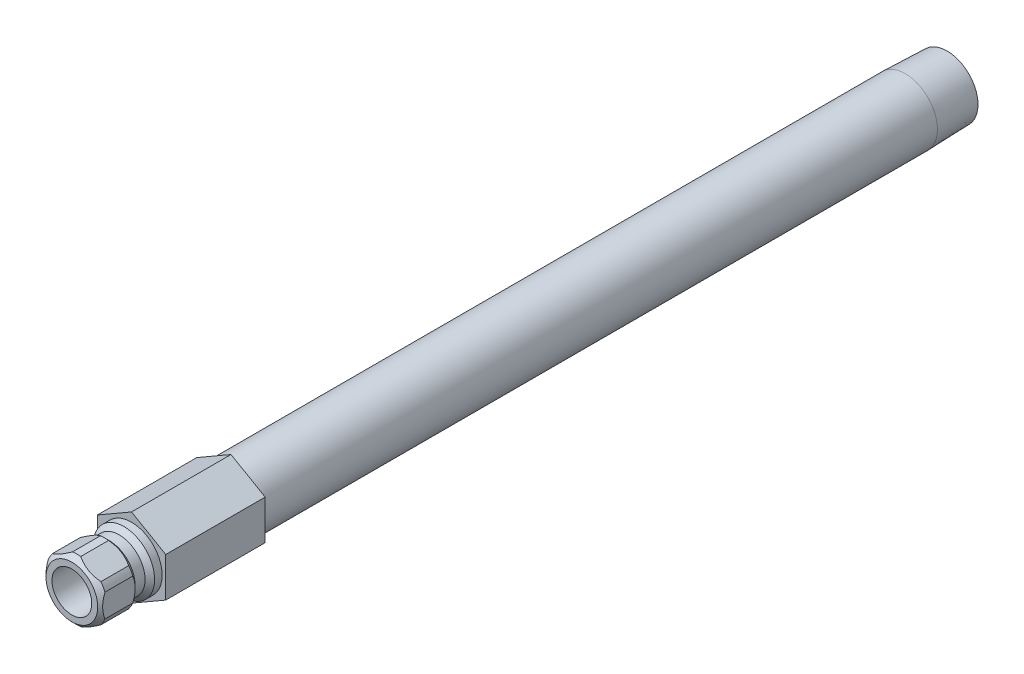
ISO-10303-21;
HEADER;
FILE_DESCRIPTION(('STEP AP214'),'2;1');
FILE_NAME('part.step','',(''),(''),'','','');
FILE_SCHEMA(('AUTOMOTIVE_DESIGN { 1 0 10303 214 1 1 1 1 }'));
ENDSEC;
DATA;
#1=APPLICATION_CONTEXT('core data for automotive mechanical design processes');
#2=APPLICATION_PROTOCOL_DEFINITION('international standard','automotive_design',2000,#1);
#3=PRODUCT_CONTEXT('',#1,'mechanical');
#4=PRODUCT('Part','Part','',(#3));
#5=PRODUCT_RELATED_PRODUCT_CATEGORY('part','',(#4));
#6=PRODUCT_DEFINITION_FORMATION('','',#4);
#7=PRODUCT_DEFINITION_CONTEXT('part definition',#1,'design');
#8=PRODUCT_DEFINITION('design','',#6,#7);
#9=PRODUCT_DEFINITION_SHAPE('','',#8);
#10=(LENGTH_UNIT() NAMED_UNIT(*) SI_UNIT(.MILLI.,.METRE.));
#11=(NAMED_UNIT(*) PLANE_ANGLE_UNIT() SI_UNIT($,.RADIAN.));
#12=(NAMED_UNIT(*) SI_UNIT($,.STERADIAN.) SOLID_ANGLE_UNIT());
#13=UNCERTAINTY_MEASURE_WITH_UNIT(LENGTH_MEASURE(1.E-05),#10,'distance_accuracy_value','');
#14=(GEOMETRIC_REPRESENTATION_CONTEXT(3) GLOBAL_UNCERTAINTY_ASSIGNED_CONTEXT((#13)) GLOBAL_UNIT_ASSIGNED_CONTEXT((#10,
#11,#12)) REPRESENTATION_CONTEXT('',''));
#15=CARTESIAN_POINT('',(0.,0.,0.));
#16=DIRECTION('',(0.,0.,1.));
#17=DIRECTION('',(1.,0.,0.));
#18=AXIS2_PLACEMENT_3D('',#15,#16,#17);
#19=CARTESIAN_POINT('',(0.,0.,0.));
#20=DIRECTION('',(0.,0.,-1.));
#21=DIRECTION('',(0.,1.,0.));
#22=AXIS2_PLACEMENT_3D('',#19,#20,#21);
#23=CYLINDRICAL_SURFACE('',#22,4.8895);
#24=DIRECTION('',(0.,0.,-1.));
#25=VECTOR('',#24,1.);
#26=CARTESIAN_POINT('',(-4.5212,-1.86170910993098,0.));
#27=LINE('',#26,#25);
#28=CARTESIAN_POINT('',(-4.5212,-1.86170910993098,4.318));
#29=VERTEX_POINT('',#28);
#30=CARTESIAN_POINT('',(-4.5212,-1.86170910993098,8.763));
#31=VERTEX_POINT('',#30);
#32=EDGE_CURVE('E61',#29,#31,#27,.F.);
#33=ORIENTED_EDGE('',*,*,#32,.F.);
#34=CARTESIAN_POINT('',(0.,0.,4.318));
#35=DIRECTION('',(0.,0.,-1.));
#36=DIRECTION('',(0.,1.,0.));
#37=AXIS2_PLACEMENT_3D('',#34,#35,#36);
#38=CIRCLE('',#37,4.8895);
#39=CARTESIAN_POINT('',(-3.87288738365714,-2.98461950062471,4.318));
#40=VERTEX_POINT('',#39);
#41=EDGE_CURVE('E650',#40,#29,#38,.T.);
#42=ORIENTED_EDGE('',*,*,#41,.F.);
#43=DIRECTION('',(0.,0.,-1.));
#44=VECTOR('',#43,1.);
#45=CARTESIAN_POINT('',(-3.87288738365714,-2.98461950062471,0.));
#46=LINE('',#45,#44);
#47=CARTESIAN_POINT('',(-3.87288738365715,-2.98461950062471,8.763));
#48=VERTEX_POINT('',#47);
#49=EDGE_CURVE('E218',#48,#40,#46,.T.);
#50=ORIENTED_EDGE('',*,*,#49,.F.);
#51=CARTESIAN_POINT('',(0.,0.,8.763));
#52=DIRECTION('',(0.,0.,-1.));
#53=DIRECTION('',(0.,1.,0.));
#54=AXIS2_PLACEMENT_3D('',#51,#52,#53);
#55=CIRCLE('',#54,4.8895);
#56=EDGE_CURVE('E189',#48,#31,#55,.T.);
#57=ORIENTED_EDGE('',*,*,#56,.T.);
#58=EDGE_LOOP('',(#33,#42,#50,#57));
#59=FACE_BOUND('',#58,.T.);
#60=ADVANCED_FACE('F34',(#59),#23,.T.);
#61=DIRECTION('',(0.,0.,-1.));
#62=VECTOR('',#61,1.);
#63=CARTESIAN_POINT('',(-0.648312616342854,-4.84632861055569,0.));
#64=LINE('',#63,#62);
#65=CARTESIAN_POINT('',(-0.648312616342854,-4.84632861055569,4.318));
#66=VERTEX_POINT('',#65);
#67=CARTESIAN_POINT('',(-0.648312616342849,-4.84632861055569,8.763));
#68=VERTEX_POINT('',#67);
#69=EDGE_CURVE('E232',#66,#68,#64,.F.);
#70=ORIENTED_EDGE('',*,*,#69,.F.);
#71=CARTESIAN_POINT('',(0.648312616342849,-4.84632861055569,4.318));
#72=VERTEX_POINT('',#71);
#73=EDGE_CURVE('E388',#72,#66,#38,.T.);
#74=ORIENTED_EDGE('',*,*,#73,.F.);
#75=DIRECTION('',(0.,0.,-1.));
#76=VECTOR('',#75,1.);
#77=CARTESIAN_POINT('',(0.648312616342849,-4.84632861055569,0.));
#78=LINE('',#77,#76);
#79=CARTESIAN_POINT('',(0.648312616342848,-4.84632861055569,8.763));
#80=VERTEX_POINT('',#79);
#81=EDGE_CURVE('E654',#80,#72,#78,.T.);
#82=ORIENTED_EDGE('',*,*,#81,.F.);
#83=EDGE_CURVE('E202',#80,#68,#55,.T.);
#84=ORIENTED_EDGE('',*,*,#83,.T.);
#85=EDGE_LOOP('',(#70,#74,#82,#84));
#86=FACE_BOUND('',#85,.T.);
#87=ADVANCED_FACE('F351',(#86),#23,.T.);
#88=DIRECTION('',(0.,0.,-1.));
#89=VECTOR('',#88,1.);
#90=CARTESIAN_POINT('',(3.87288738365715,-2.98461950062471,0.));
#91=LINE('',#90,#89);
#92=CARTESIAN_POINT('',(3.87288738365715,-2.98461950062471,4.318));
#93=VERTEX_POINT('',#92);
#94=CARTESIAN_POINT('',(3.87288738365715,-2.98461950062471,8.763));
#95=VERTEX_POINT('',#94);
#96=EDGE_CURVE('E294',#93,#95,#91,.F.);
#97=ORIENTED_EDGE('',*,*,#96,.F.);
#98=CARTESIAN_POINT('',(4.5212,-1.86170910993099,4.318));
#99=VERTEX_POINT('',#98);
#100=EDGE_CURVE('E384',#99,#93,#38,.T.);
#101=ORIENTED_EDGE('',*,*,#100,.F.);
#102=DIRECTION('',(0.,0.,-1.));
#103=VECTOR('',#102,1.);
#104=CARTESIAN_POINT('',(4.5212,-1.86170910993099,0.));
#105=LINE('',#104,#103);
#106=CARTESIAN_POINT('',(4.5212,-1.86170910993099,8.763));
#107=VERTEX_POINT('',#106);
#108=EDGE_CURVE('E377',#107,#99,#105,.T.);
#109=ORIENTED_EDGE('',*,*,#108,.F.);
#110=EDGE_CURVE('E195',#107,#95,#55,.T.);
#111=ORIENTED_EDGE('',*,*,#110,.T.);
#112=EDGE_LOOP('',(#97,#101,#109,#111));
#113=FACE_BOUND('',#112,.T.);
#114=ADVANCED_FACE('F355',(#113),#23,.T.);
#115=DIRECTION('',(0.,0.,-1.));
#116=VECTOR('',#115,1.);
#117=CARTESIAN_POINT('',(4.5212,1.86170910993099,0.));
#118=LINE('',#117,#116);
#119=CARTESIAN_POINT('',(4.5212,1.86170910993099,4.318));
#120=VERTEX_POINT('',#119);
#121=CARTESIAN_POINT('',(4.5212,1.86170910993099,8.763));
#122=VERTEX_POINT('',#121);
#123=EDGE_CURVE('E373',#120,#122,#118,.F.);
#124=ORIENTED_EDGE('',*,*,#123,.F.);
#125=CARTESIAN_POINT('',(3.87288738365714,2.98461950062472,4.318));
#126=VERTEX_POINT('',#125);
#127=EDGE_CURVE('E200',#126,#120,#38,.T.);
#128=ORIENTED_EDGE('',*,*,#127,.F.);
#129=DIRECTION('',(0.,0.,-1.));
#130=VECTOR('',#129,1.);
#131=CARTESIAN_POINT('',(3.87288738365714,2.98461950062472,0.));
#132=LINE('',#131,#130);
#133=CARTESIAN_POINT('',(3.87288738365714,2.98461950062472,8.763));
#134=VERTEX_POINT('',#133);
#135=EDGE_CURVE('E651',#134,#126,#132,.T.);
#136=ORIENTED_EDGE('',*,*,#135,.F.);
#137=EDGE_CURVE('E188',#134,#122,#55,.T.);
#138=ORIENTED_EDGE('',*,*,#137,.T.);
#139=EDGE_LOOP('',(#124,#128,#136,#138));
#140=FACE_BOUND('',#139,.T.);
#141=ADVANCED_FACE('F361',(#140),#23,.T.);
#142=DIRECTION('',(0.,0.,-1.));
#143=VECTOR('',#142,1.);
#144=CARTESIAN_POINT('',(0.648312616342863,4.84632861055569,0.));
#145=LINE('',#144,#143);
#146=CARTESIAN_POINT('',(0.648312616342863,4.84632861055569,4.318));
#147=VERTEX_POINT('',#146);
#148=CARTESIAN_POINT('',(0.648312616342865,4.84632861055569,8.763));
#149=VERTEX_POINT('',#148);
#150=EDGE_CURVE('E652',#147,#149,#145,.F.);
#151=ORIENTED_EDGE('',*,*,#150,.F.);
#152=CARTESIAN_POINT('',(-0.648312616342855,4.84632861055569,4.318));
#153=VERTEX_POINT('',#152);
#154=EDGE_CURVE('E179',#153,#147,#38,.T.);
#155=ORIENTED_EDGE('',*,*,#154,.F.);
#156=DIRECTION('',(0.,0.,-1.));
#157=VECTOR('',#156,1.);
#158=CARTESIAN_POINT('',(-0.648312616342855,4.84632861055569,0.));
#159=LINE('',#158,#157);
#160=CARTESIAN_POINT('',(-0.648312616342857,4.84632861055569,8.763));
#161=VERTEX_POINT('',#160);
#162=EDGE_CURVE('E163',#161,#153,#159,.T.);
#163=ORIENTED_EDGE('',*,*,#162,.F.);
#164=EDGE_CURVE('E177',#161,#149,#55,.T.);
#165=ORIENTED_EDGE('',*,*,#164,.T.);
#166=EDGE_LOOP('',(#151,#155,#163,#165));
#167=FACE_BOUND('',#166,.T.);
#168=ADVANCED_FACE('F176',(#167),#23,.T.);
#169=CARTESIAN_POINT('',(0.,4.8895,0.));
#170=DIRECTION('',(0.,0.,1.));
#171=DIRECTION('',(0.,-1.,0.));
#172=AXIS2_PLACEMENT_3D('',#169,#170,#171);
#173=PLANE('',#172);
#174=CARTESIAN_POINT('',(0.,0.,0.));
#175=DIRECTION('',(0.,0.,-1.));
#176=DIRECTION('',(0.,1.,0.));
#177=AXIS2_PLACEMENT_3D('',#174,#175,#176);
#178=CIRCLE('',#177,4.8895);
#179=CARTESIAN_POINT('',(0.,4.8895,0.));
#180=VERTEX_POINT('',#179);
#181=EDGE_CURVE('E395',#180,#180,#178,.T.);
#182=ORIENTED_EDGE('',*,*,#181,.T.);
#183=EDGE_LOOP('',(#182));
#184=FACE_BOUND('',#183,.T.);
#185=DIRECTION('',(-0.866025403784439,-0.5,0.));
#186=VECTOR('',#185,1.);
#187=CARTESIAN_POINT('',(0.,6.3058196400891,0.));
#188=LINE('',#187,#186);
#189=CARTESIAN_POINT('',(0.,6.3058196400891,0.));
#190=VERTEX_POINT('',#189);
#191=CARTESIAN_POINT('',(-5.461,3.15290982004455,0.));
#192=VERTEX_POINT('',#191);
#193=EDGE_CURVE('E445',#190,#192,#188,.T.);
#194=ORIENTED_EDGE('',*,*,#193,.T.);
#195=DIRECTION('',(0.,-1.,0.));
#196=VECTOR('',#195,1.);
#197=CARTESIAN_POINT('',(-5.461,3.15290982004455,0.));
#198=LINE('',#197,#196);
#199=CARTESIAN_POINT('',(-5.461,-3.15290982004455,0.));
#200=VERTEX_POINT('',#199);
#201=EDGE_CURVE('E448',#192,#200,#198,.T.);
#202=ORIENTED_EDGE('',*,*,#201,.T.);
#203=DIRECTION('',(0.866025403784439,-0.5,0.));
#204=VECTOR('',#203,1.);
#205=CARTESIAN_POINT('',(-5.461,-3.15290982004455,0.));
#206=LINE('',#205,#204);
#207=CARTESIAN_POINT('',(0.,-6.30581964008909,0.));
#208=VERTEX_POINT('',#207);
#209=EDGE_CURVE('E451',#200,#208,#206,.T.);
#210=ORIENTED_EDGE('',*,*,#209,.T.);
#211=DIRECTION('',(0.866025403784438,0.5,0.));
#212=VECTOR('',#211,1.);
#213=CARTESIAN_POINT('',(0.,-6.30581964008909,0.));
#214=LINE('',#213,#212);
#215=CARTESIAN_POINT('',(5.461,-3.15290982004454,0.));
#216=VERTEX_POINT('',#215);
#217=EDGE_CURVE('E454',#208,#216,#214,.T.);
#218=ORIENTED_EDGE('',*,*,#217,.T.);
#219=DIRECTION('',(0.,1.,0.));
#220=VECTOR('',#219,1.);
#221=CARTESIAN_POINT('',(5.461,-3.15290982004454,0.));
#222=LINE('',#221,#220);
#223=CARTESIAN_POINT('',(5.461,3.15290982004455,0.));
#224=VERTEX_POINT('',#223);
#225=EDGE_CURVE('E456',#216,#224,#222,.T.);
#226=ORIENTED_EDGE('',*,*,#225,.T.);
#227=DIRECTION('',(-0.866025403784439,0.5,0.));
#228=VECTOR('',#227,1.);
#229=CARTESIAN_POINT('',(5.461,3.15290982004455,0.));
#230=LINE('',#229,#228);
#231=EDGE_CURVE('E424',#224,#190,#230,.T.);
#232=ORIENTED_EDGE('',*,*,#231,.T.);
#233=EDGE_LOOP('',(#194,#202,#210,#218,#226,#232));
#234=FACE_BOUND('',#233,.T.);
#235=ADVANCED_FACE('F360',(#184,#234),#173,.T.);
#236=CARTESIAN_POINT('',(0.,0.,0.));
#237=DIRECTION('',(0.,0.,-1.));
#238=DIRECTION('',(0.,1.,0.));
#239=AXIS2_PLACEMENT_3D('',#236,#237,#238);
#240=CYLINDRICAL_SURFACE('',#239,4.8895);
#241=CARTESIAN_POINT('',(0.,0.,1.2065));
#242=DIRECTION('',(0.,0.,-1.));
#243=DIRECTION('',(0.,1.,0.));
#244=AXIS2_PLACEMENT_3D('',#241,#242,#243);
#245=CIRCLE('',#244,4.8895);
#246=CARTESIAN_POINT('',(0.,4.8895,1.2065));
#247=VERTEX_POINT('',#246);
#248=EDGE_CURVE('E392',#247,#247,#245,.T.);
#249=ORIENTED_EDGE('',*,*,#248,.T.);
#250=EDGE_LOOP('',(#249));
#251=FACE_BOUND('',#250,.T.);
#252=ORIENTED_EDGE('',*,*,#181,.F.);
#253=EDGE_LOOP('',(#252));
#254=FACE_BOUND('',#253,.T.);
#255=ADVANCED_FACE('F366',(#251,#254),#240,.T.);
#256=CARTESIAN_POINT('',(0.,0.,1.2065));
#257=DIRECTION('',(0.,0.,-1.));
#258=DIRECTION('',(0.,1.,0.));
#259=AXIS2_PLACEMENT_3D('',#256,#257,#258);
#260=CONICAL_SURFACE('',#259,4.8895,0.785398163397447);
#261=CARTESIAN_POINT('',(0.,0.,1.9685));
#262=DIRECTION('',(0.,0.,-1.));
#263=DIRECTION('',(0.,1.,0.));
#264=AXIS2_PLACEMENT_3D('',#261,#262,#263);
#265=CIRCLE('',#264,4.1275);
#266=CARTESIAN_POINT('',(0.,4.1275,1.9685));
#267=VERTEX_POINT('',#266);
#268=EDGE_CURVE('E386',#267,#267,#265,.T.);
#269=ORIENTED_EDGE('',*,*,#268,.T.);
#270=EDGE_LOOP('',(#269));
#271=FACE_BOUND('',#270,.T.);
#272=ORIENTED_EDGE('',*,*,#248,.F.);
#273=EDGE_LOOP('',(#272));
#274=FACE_BOUND('',#273,.T.);
#275=ADVANCED_FACE('F704',(#271,#274),#260,.T.);
#276=CARTESIAN_POINT('',(0.,0.,0.));
#277=DIRECTION('',(0.,0.,-1.));
#278=DIRECTION('',(0.,1.,0.));
#279=AXIS2_PLACEMENT_3D('',#276,#277,#278);
#280=CYLINDRICAL_SURFACE('',#279,4.1275);
#281=CARTESIAN_POINT('',(0.,0.,3.556));
#282=DIRECTION('',(0.,0.,-1.));
#283=DIRECTION('',(0.,1.,0.));
#284=AXIS2_PLACEMENT_3D('',#281,#282,#283);
#285=CIRCLE('',#284,4.1275);
#286=CARTESIAN_POINT('',(0.,4.1275,3.556));
#287=VERTEX_POINT('',#286);
#288=EDGE_CURVE('E383',#287,#287,#285,.T.);
#289=ORIENTED_EDGE('',*,*,#288,.T.);
#290=EDGE_LOOP('',(#289));
#291=FACE_BOUND('',#290,.T.);
#292=ORIENTED_EDGE('',*,*,#268,.F.);
#293=EDGE_LOOP('',(#292));
#294=FACE_BOUND('',#293,.T.);
#295=ADVANCED_FACE('F254',(#291,#294),#280,.T.);
#296=CARTESIAN_POINT('',(0.,0.,3.556));
#297=DIRECTION('',(0.,0.,1.));
#298=DIRECTION('',(0.,-1.,0.));
#299=AXIS2_PLACEMENT_3D('',#296,#297,#298);
#300=CONICAL_SURFACE('',#299,4.1275,0.785398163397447);
#301=CARTESIAN_POINT('',(-4.5212,-5.15925306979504,6.2884665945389));
#302=CARTESIAN_POINT('',(-4.5212,-5.03341781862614,6.19384981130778));
#303=CARTESIAN_POINT('',(-4.5212,-4.90687282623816,6.10016148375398));
#304=CARTESIAN_POINT('',(-4.5212,-4.65208542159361,5.91505573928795));
#305=CARTESIAN_POINT('',(-4.5212,-4.52384258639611,5.82363890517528));
#306=CARTESIAN_POINT('',(-4.5212,-4.26444371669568,5.64284060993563));
#307=CARTESIAN_POINT('',(-4.5212,-4.13327280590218,5.55348041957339));
#308=CARTESIAN_POINT('',(-4.5212,-3.86869655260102,5.37814219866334));
#309=CARTESIAN_POINT('',(-4.5212,-3.735291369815,5.29216392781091));
#310=CARTESIAN_POINT('',(-4.5212,-3.45835736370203,5.1196421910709));
#311=CARTESIAN_POINT('',(-4.5212,-3.31467977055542,5.03333631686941));
#312=CARTESIAN_POINT('',(-4.5212,-3.02397608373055,4.86646929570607));
#313=CARTESIAN_POINT('',(-4.5212,-2.87694947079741,4.78590904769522));
#314=CARTESIAN_POINT('',(-4.5212,-2.57957206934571,4.6322757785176));
#315=CARTESIAN_POINT('',(-4.5212,-2.42923274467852,4.55918074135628));
#316=CARTESIAN_POINT('',(-4.5212,-2.12448469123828,4.42211381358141));
#317=CARTESIAN_POINT('',(-4.5212,-1.97007782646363,4.35813782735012));
#318=CARTESIAN_POINT('',(-4.5212,-1.66898205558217,4.24604782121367));
#319=CARTESIAN_POINT('',(-4.5212,-1.52260919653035,4.19709368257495));
#320=CARTESIAN_POINT('',(-4.5212,-1.22638031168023,4.11093488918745));
#321=CARTESIAN_POINT('',(-4.5212,-1.07652404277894,4.07373105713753));
#322=CARTESIAN_POINT('',(-4.5212,-0.776693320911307,4.01362130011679));
#323=CARTESIAN_POINT('',(-4.5212,-0.626768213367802,3.99047322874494));
#324=CARTESIAN_POINT('',(-4.5212,-0.325366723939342,3.95891692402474));
#325=CARTESIAN_POINT('',(-4.5212,-0.173890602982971,3.95050625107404));
#326=CARTESIAN_POINT('',(-4.5212,0.123852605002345,3.94903068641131));
#327=CARTESIAN_POINT('',(-4.5212,0.270117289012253,3.95544130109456));
#328=CARTESIAN_POINT('',(-4.5212,0.561370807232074,3.98210770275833));
#329=CARTESIAN_POINT('',(-4.5212,0.706359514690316,4.0023648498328));
#330=CARTESIAN_POINT('',(-4.5212,0.996462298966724,4.05597163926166));
#331=CARTESIAN_POINT('',(-4.5212,1.14153485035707,4.08954247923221));
#332=CARTESIAN_POINT('',(-4.5212,1.42852462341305,4.16800024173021));
#333=CARTESIAN_POINT('',(-4.5212,1.5704421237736,4.21288616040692));
#334=CARTESIAN_POINT('',(-4.5212,1.86505501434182,4.3171412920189));
#335=CARTESIAN_POINT('',(-4.5212,2.01739126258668,4.37751543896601));
#336=CARTESIAN_POINT('',(-4.5212,2.31809735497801,4.5075182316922));
#337=CARTESIAN_POINT('',(-4.5212,2.46646529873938,4.57715121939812));
#338=CARTESIAN_POINT('',(-4.5212,2.75996557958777,4.72401353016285));
#339=CARTESIAN_POINT('',(-4.5212,2.90508583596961,4.80126680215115));
#340=CARTESIAN_POINT('',(-4.5212,3.19198335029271,4.96166050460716));
#341=CARTESIAN_POINT('',(-4.5212,3.33376113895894,5.04479999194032));
#342=CARTESIAN_POINT('',(-4.5212,3.60742153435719,5.21154136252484));
#343=CARTESIAN_POINT('',(-4.5212,3.73944496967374,5.29491333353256));
#344=CARTESIAN_POINT('',(-4.5212,4.00122581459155,5.4651527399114));
#345=CARTESIAN_POINT('',(-4.5212,4.13098305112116,5.55202044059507));
#346=CARTESIAN_POINT('',(-4.5212,4.387473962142,5.72790624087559));
#347=CARTESIAN_POINT('',(-4.5212,4.51422365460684,5.81690106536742));
#348=CARTESIAN_POINT('',(-4.5212,4.76599253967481,5.99723636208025));
#349=CARTESIAN_POINT('',(-4.5212,4.8910121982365,6.08857618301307));
#350=CARTESIAN_POINT('',(-4.5212,5.01530771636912,6.18087446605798));
#351=B_SPLINE_CURVE_WITH_KNOTS('',3,(#301,#302,#303,#304,#305,#306,#307,#308,#309,#310,#311,
#312,#313,#314,#315,#316,#317,#318,#319,#320,#321,#322,#323,#324,#325,#326,#327,#328,#329,#330,
#331,#332,#333,#334,#335,#336,#337,#338,#339,#340,#341,#342,#343,#344,#345,#346,#347,#348,#349,
#350),.UNSPECIFIED.,.F.,.F.,(4,2,2,2,2,2,2,2,2,2,2,2,2,2,2,2,2,2,2,2,2,2,2,2,4),(0.,
0.472324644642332,0.944769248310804,1.42087610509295,1.89694907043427,2.39966187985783,
2.90245317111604,3.40371602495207,3.90475303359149,4.3673713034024,4.83002195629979,
5.28445770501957,5.73881822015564,6.1773471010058,6.615919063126,7.06210522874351,
7.50825182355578,7.9994594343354,8.49089821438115,8.98393391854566,9.47689080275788,
9.94525924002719,10.4136632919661,10.8782525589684,11.3427141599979),.UNSPECIFIED.);
#352=CARTESIAN_POINT('',(-4.5212,1.86170910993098,4.318));
#353=VERTEX_POINT('',#352);
#354=EDGE_CURVE('E230',#353,#29,#351,.F.);
#355=ORIENTED_EDGE('',*,*,#354,.F.);
#356=CARTESIAN_POINT('',(-3.87288738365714,2.98461950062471,4.318));
#357=VERTEX_POINT('',#356);
#358=EDGE_CURVE('E199',#353,#357,#38,.T.);
#359=ORIENTED_EDGE('',*,*,#358,.T.);
#360=CARTESIAN_POINT('',(-0.647857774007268,4.84659121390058,4.3182));
#361=CARTESIAN_POINT('',(-0.775261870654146,4.77303442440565,4.26213711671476));
#362=CARTESIAN_POINT('',(-0.904457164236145,4.69844348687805,4.21102627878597));
#363=CARTESIAN_POINT('',(-1.16629518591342,4.5472712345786,4.12074318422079));
#364=CARTESIAN_POINT('',(-1.29894624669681,4.47068510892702,4.08160338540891));
#365=CARTESIAN_POINT('',(-1.56203676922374,4.31878972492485,4.01877592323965));
#366=CARTESIAN_POINT('',(-1.69238331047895,4.24353411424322,3.99458163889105));
#367=CARTESIAN_POINT('',(-1.95434729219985,4.09228913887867,3.96102228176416));
#368=CARTESIAN_POINT('',(-2.0859628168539,4.01630088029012,3.95163757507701));
#369=CARTESIAN_POINT('',(-2.35623055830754,3.86026172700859,3.9482192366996));
#370=CARTESIAN_POINT('',(-2.49489129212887,3.78020591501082,3.95501290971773));
#371=CARTESIAN_POINT('',(-2.7710334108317,3.62077518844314,3.98518499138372));
#372=CARTESIAN_POINT('',(-2.90851272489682,3.54140146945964,4.00858815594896));
#373=CARTESIAN_POINT('',(-3.18622016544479,3.38106700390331,4.07155129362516));
#374=CARTESIAN_POINT('',(-3.32634361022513,3.3001666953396,4.11171074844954));
#375=CARTESIAN_POINT('',(-3.60275664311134,3.14057955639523,4.20550294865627));
#376=CARTESIAN_POINT('',(-3.73905611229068,3.06188702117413,4.2590965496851));
#377=CARTESIAN_POINT('',(-3.87334222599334,2.98435689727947,4.31820000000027));
#378=B_SPLINE_CURVE_WITH_KNOTS('',3,(#360,#361,#362,#363,#364,#365,#366,#367,#368,#369,#370,
#371,#372,#373,#374,#375,#376,#377),.UNSPECIFIED.,.F.,.F.,(4,2,2,2,2,2,2,2,4),(0.,
0.472469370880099,0.946208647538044,1.40285320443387,1.85889185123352,2.33874707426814,
2.81931901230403,3.31879975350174,3.81684169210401),.UNSPECIFIED.);
#379=EDGE_CURVE('E260',#153,#357,#378,.T.);
#380=ORIENTED_EDGE('',*,*,#379,.F.);
#381=ORIENTED_EDGE('',*,*,#154,.T.);
#382=CARTESIAN_POINT('',(3.87334222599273,2.98435689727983,4.3182));
#383=CARTESIAN_POINT('',(3.74593812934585,3.05791368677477,4.26213711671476));
#384=CARTESIAN_POINT('',(3.61674283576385,3.13250462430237,4.21102627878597));
#385=CARTESIAN_POINT('',(3.35490481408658,3.28367687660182,4.12074318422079));
#386=CARTESIAN_POINT('',(3.22225375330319,3.3602630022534,4.08160338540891));
#387=CARTESIAN_POINT('',(2.95916323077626,3.51215838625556,4.01877592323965));
#388=CARTESIAN_POINT('',(2.82881668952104,3.5874139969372,3.99458163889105));
#389=CARTESIAN_POINT('',(2.56685270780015,3.73865897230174,3.96102228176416));
#390=CARTESIAN_POINT('',(2.4352371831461,3.81464723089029,3.95163757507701));
#391=CARTESIAN_POINT('',(2.16496944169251,3.97068638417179,3.94821923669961));
#392=CARTESIAN_POINT('',(2.02630870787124,4.05074219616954,3.95501290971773));
#393=CARTESIAN_POINT('',(1.75016658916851,4.21017292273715,3.98518499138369));
#394=CARTESIAN_POINT('',(1.61268727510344,4.28954664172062,4.00858815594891));
#395=CARTESIAN_POINT('',(1.33497983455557,4.44988110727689,4.07155129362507));
#396=CARTESIAN_POINT('',(1.19485638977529,4.53078141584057,4.11171074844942));
#397=CARTESIAN_POINT('',(0.918443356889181,4.69036855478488,4.20550294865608));
#398=CARTESIAN_POINT('',(0.782143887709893,4.76906109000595,4.25909654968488));
#399=CARTESIAN_POINT('',(0.647857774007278,4.84659121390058,4.3182));
#400=B_SPLINE_CURVE_WITH_KNOTS('',3,(#382,#383,#384,#385,#386,#387,#388,#389,#390,#391,#392,
#393,#394,#395,#396,#397,#398,#399),.UNSPECIFIED.,.F.,.F.,(4,2,2,2,2,2,2,2,4),(0.,
0.472469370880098,0.946208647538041,1.40285320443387,1.85889185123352,2.33874707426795,
2.81931901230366,3.31879975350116,3.81684169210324),.UNSPECIFIED.);
#401=EDGE_CURVE('E270',#126,#147,#400,.T.);
#402=ORIENTED_EDGE('',*,*,#401,.F.);
#403=ORIENTED_EDGE('',*,*,#127,.T.);
#404=CARTESIAN_POINT('',(4.5212,-5.15925306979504,6.2884665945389));
#405=CARTESIAN_POINT('',(4.5212,-5.03341781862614,6.19384981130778));
#406=CARTESIAN_POINT('',(4.5212,-4.90687282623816,6.10016148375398));
#407=CARTESIAN_POINT('',(4.5212,-4.65208542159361,5.91505573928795));
#408=CARTESIAN_POINT('',(4.5212,-4.52384258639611,5.82363890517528));
#409=CARTESIAN_POINT('',(4.5212,-4.26444371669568,5.64284060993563));
#410=CARTESIAN_POINT('',(4.5212,-4.13327280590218,5.55348041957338));
#411=CARTESIAN_POINT('',(4.5212,-3.86869655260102,5.37814219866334));
#412=CARTESIAN_POINT('',(4.5212,-3.735291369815,5.2921639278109));
#413=CARTESIAN_POINT('',(4.5212,-3.45835736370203,5.1196421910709));
#414=CARTESIAN_POINT('',(4.5212,-3.31467977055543,5.03333631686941));
#415=CARTESIAN_POINT('',(4.5212,-3.02397608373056,4.86646929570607));
#416=CARTESIAN_POINT('',(4.5212,-2.87694947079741,4.78590904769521));
#417=CARTESIAN_POINT('',(4.5212,-2.57957206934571,4.63227577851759));
#418=CARTESIAN_POINT('',(4.5212,-2.42923274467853,4.55918074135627));
#419=CARTESIAN_POINT('',(4.5212,-2.12448469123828,4.4221138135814));
#420=CARTESIAN_POINT('',(4.5212,-1.97007782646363,4.35813782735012));
#421=CARTESIAN_POINT('',(4.5212,-1.66898205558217,4.24604782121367));
#422=CARTESIAN_POINT('',(4.5212,-1.52260919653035,4.19709368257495));
#423=CARTESIAN_POINT('',(4.5212,-1.22638031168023,4.11093488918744));
#424=CARTESIAN_POINT('',(4.5212,-1.07652404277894,4.07373105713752));
#425=CARTESIAN_POINT('',(4.5212,-0.776693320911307,4.01362130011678));
#426=CARTESIAN_POINT('',(4.5212,-0.626768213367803,3.99047322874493));
#427=CARTESIAN_POINT('',(4.5212,-0.325366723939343,3.95891692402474));
#428=CARTESIAN_POINT('',(4.5212,-0.173890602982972,3.95050625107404));
#429=CARTESIAN_POINT('',(4.5212,0.123852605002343,3.94903068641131));
#430=CARTESIAN_POINT('',(4.5212,0.27011728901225,3.95544130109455));
#431=CARTESIAN_POINT('',(4.5212,0.561370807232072,3.98210770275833));
#432=CARTESIAN_POINT('',(4.5212,0.706359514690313,4.0023648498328));
#433=CARTESIAN_POINT('',(4.5212,0.99646229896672,4.05597163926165));
#434=CARTESIAN_POINT('',(4.5212,1.14153485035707,4.08954247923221));
#435=CARTESIAN_POINT('',(4.5212,1.42852462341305,4.16800024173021));
#436=CARTESIAN_POINT('',(4.5212,1.5704421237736,4.21288616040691));
#437=CARTESIAN_POINT('',(4.5212,1.86505501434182,4.3171412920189));
#438=CARTESIAN_POINT('',(4.5212,2.01739126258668,4.377515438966));
#439=CARTESIAN_POINT('',(4.5212,2.318097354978,4.50751823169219));
#440=CARTESIAN_POINT('',(4.5212,2.46646529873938,4.57715121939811));
#441=CARTESIAN_POINT('',(4.5212,2.75996557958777,4.72401353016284));
#442=CARTESIAN_POINT('',(4.5212,2.9050858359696,4.80126680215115));
#443=CARTESIAN_POINT('',(4.5212,3.1919833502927,4.96166050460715));
#444=CARTESIAN_POINT('',(4.5212,3.33376113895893,5.04479999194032));
#445=CARTESIAN_POINT('',(4.5212,3.60742153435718,5.21154136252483));
#446=CARTESIAN_POINT('',(4.5212,3.73944496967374,5.29491333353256));
#447=CARTESIAN_POINT('',(4.5212,4.00122581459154,5.46515273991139));
#448=CARTESIAN_POINT('',(4.5212,4.13098305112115,5.55202044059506));
#449=CARTESIAN_POINT('',(4.5212,4.38747396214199,5.72790624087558));
#450=CARTESIAN_POINT('',(4.5212,4.51422365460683,5.81690106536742));
#451=CARTESIAN_POINT('',(4.5212,4.76599253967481,5.99723636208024));
#452=CARTESIAN_POINT('',(4.5212,4.89101219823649,6.08857618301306));
#453=CARTESIAN_POINT('',(4.5212,5.01530771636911,6.18087446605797));
#454=B_SPLINE_CURVE_WITH_KNOTS('',3,(#404,#405,#406,#407,#408,#409,#410,#411,#412,#413,#414,
#415,#416,#417,#418,#419,#420,#421,#422,#423,#424,#425,#426,#427,#428,#429,#430,#431,#432,#433,
#434,#435,#436,#437,#438,#439,#440,#441,#442,#443,#444,#445,#446,#447,#448,#449,#450,#451,#452,
#453),.UNSPECIFIED.,.F.,.F.,(4,2,2,2,2,2,2,2,2,2,2,2,2,2,2,2,2,2,2,2,2,2,2,2,4),(0.,
0.472324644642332,0.944769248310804,1.42087610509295,1.89694907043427,2.39966187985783,
2.90245317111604,3.40371602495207,3.90475303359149,4.3673713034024,4.83002195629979,
5.28445770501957,5.73881822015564,6.1773471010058,6.615919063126,7.06210522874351,
7.50825182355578,7.9994594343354,8.49089821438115,8.98393391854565,9.47689080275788,
9.94525924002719,10.4136632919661,10.8782525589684,11.3427141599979),.UNSPECIFIED.);
#455=EDGE_CURVE('E279',#99,#120,#454,.T.);
#456=ORIENTED_EDGE('',*,*,#455,.F.);
#457=ORIENTED_EDGE('',*,*,#100,.T.);
#458=CARTESIAN_POINT('',(0.647857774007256,-4.84659121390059,4.3182));
#459=CARTESIAN_POINT('',(0.775261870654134,-4.77303442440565,4.26213711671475));
#460=CARTESIAN_POINT('',(0.904457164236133,-4.69844348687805,4.21102627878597));
#461=CARTESIAN_POINT('',(1.16629518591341,-4.5472712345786,4.12074318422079));
#462=CARTESIAN_POINT('',(1.2989462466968,-4.47068510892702,4.08160338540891));
#463=CARTESIAN_POINT('',(1.56203676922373,-4.31878972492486,4.01877592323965));
#464=CARTESIAN_POINT('',(1.69238331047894,-4.24353411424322,3.99458163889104));
#465=CARTESIAN_POINT('',(1.95434729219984,-4.09228913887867,3.96102228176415));
#466=CARTESIAN_POINT('',(2.08596281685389,-4.01630088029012,3.951637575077));
#467=CARTESIAN_POINT('',(2.35623055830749,-3.86026172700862,3.9482192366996));
#468=CARTESIAN_POINT('',(2.49489129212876,-3.78020591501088,3.95501290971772));
#469=CARTESIAN_POINT('',(2.77103341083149,-3.62077518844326,3.98518499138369));
#470=CARTESIAN_POINT('',(2.90851272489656,-3.54140146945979,4.0085881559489));
#471=CARTESIAN_POINT('',(3.18622016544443,-3.38106700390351,4.07155129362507));
#472=CARTESIAN_POINT('',(3.32634361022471,-3.30016669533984,4.11171074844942));
#473=CARTESIAN_POINT('',(3.60275664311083,-3.14057955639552,4.20550294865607));
#474=CARTESIAN_POINT('',(3.73905611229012,-3.06188702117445,4.25909654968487));
#475=CARTESIAN_POINT('',(3.87334222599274,-2.98435689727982,4.3182));
#476=B_SPLINE_CURVE_WITH_KNOTS('',3,(#458,#459,#460,#461,#462,#463,#464,#465,#466,#467,#468,
#469,#470,#471,#472,#473,#474,#475),.UNSPECIFIED.,.F.,.F.,(4,2,2,2,2,2,2,2,4),(0.,
0.4724693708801,0.946208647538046,1.40285320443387,1.85889185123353,2.33874707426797,
2.81931901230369,3.3187997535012,3.81684169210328),.UNSPECIFIED.);
#477=EDGE_CURVE('E287',#72,#93,#476,.T.);
#478=ORIENTED_EDGE('',*,*,#477,.F.);
#479=ORIENTED_EDGE('',*,*,#73,.T.);
#480=CARTESIAN_POINT('',(-3.87334222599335,-2.98435689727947,4.31820000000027));
#481=CARTESIAN_POINT('',(-3.74593812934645,-3.05791368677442,4.262137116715));
#482=CARTESIAN_POINT('',(-3.61674283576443,-3.13250462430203,4.21102627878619));
#483=CARTESIAN_POINT('',(-3.35490481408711,-3.28367687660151,4.12074318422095));
#484=CARTESIAN_POINT('',(-3.2222537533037,-3.3602630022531,4.08160338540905));
#485=CARTESIAN_POINT('',(-2.95916323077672,-3.51215838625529,4.01877592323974));
#486=CARTESIAN_POINT('',(-2.82881668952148,-3.58741399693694,3.99458163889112));
#487=CARTESIAN_POINT('',(-2.56685270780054,-3.73865897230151,3.96102228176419));
#488=CARTESIAN_POINT('',(-2.43523718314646,-3.81464723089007,3.95163757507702));
#489=CARTESIAN_POINT('',(-2.16496944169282,-3.97068638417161,3.94821923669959));
#490=CARTESIAN_POINT('',(-2.02630870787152,-4.05074219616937,3.95501290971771));
#491=CARTESIAN_POINT('',(-1.75016658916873,-4.21017292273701,3.98518499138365));
#492=CARTESIAN_POINT('',(-1.61268727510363,-4.2895466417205,4.00858815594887));
#493=CARTESIAN_POINT('',(-1.33497983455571,-4.44988110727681,4.07155129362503));
#494=CARTESIAN_POINT('',(-1.1948563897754,-4.5307814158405,4.11171074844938));
#495=CARTESIAN_POINT('',(-0.918443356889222,-4.69036855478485,4.20550294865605));
#496=CARTESIAN_POINT('',(-0.782143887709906,-4.76906109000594,4.25909654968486));
#497=CARTESIAN_POINT('',(-0.647857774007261,-4.84659121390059,4.3182));
#498=B_SPLINE_CURVE_WITH_KNOTS('',3,(#480,#481,#482,#483,#484,#485,#486,#487,#488,#489,#490,
#491,#492,#493,#494,#495,#496,#497),.UNSPECIFIED.,.F.,.F.,(4,2,2,2,2,2,2,2,4),(0.,
0.472469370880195,0.946208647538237,1.40285320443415,1.85889185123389,2.33874707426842,
2.81931901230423,3.31879975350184,3.81684169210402),.UNSPECIFIED.);
#499=EDGE_CURVE('E228',#40,#66,#498,.T.);
#500=ORIENTED_EDGE('',*,*,#499,.F.);
#501=ORIENTED_EDGE('',*,*,#41,.T.);
#502=EDGE_LOOP('',(#355,#359,#380,#381,#402,#403,#456,#457,#478,#479,#500,#501));
#503=FACE_BOUND('',#502,.T.);
#504=ORIENTED_EDGE('',*,*,#288,.F.);
#505=EDGE_LOOP('',(#504));
#506=FACE_BOUND('',#505,.T.);
#507=ADVANCED_FACE('F249',(#503,#506),#300,.T.);
#508=DIRECTION('',(0.,0.,-1.));
#509=VECTOR('',#508,1.);
#510=CARTESIAN_POINT('',(-4.5212,1.86170910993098,0.));
#511=LINE('',#510,#509);
#512=CARTESIAN_POINT('',(-4.5212,1.86170910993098,8.763));
#513=VERTEX_POINT('',#512);
#514=EDGE_CURVE('E222',#513,#353,#511,.T.);
#515=ORIENTED_EDGE('',*,*,#514,.F.);
#516=CARTESIAN_POINT('',(-3.87288738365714,2.98461950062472,8.763));
#517=VERTEX_POINT('',#516);
#518=EDGE_CURVE('E185',#513,#517,#55,.T.);
#519=ORIENTED_EDGE('',*,*,#518,.T.);
#520=DIRECTION('',(0.,0.,-1.));
#521=VECTOR('',#520,1.);
#522=CARTESIAN_POINT('',(-3.87288738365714,2.98461950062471,0.));
#523=LINE('',#522,#521);
#524=EDGE_CURVE('E54',#357,#517,#523,.F.);
#525=ORIENTED_EDGE('',*,*,#524,.F.);
#526=ORIENTED_EDGE('',*,*,#358,.F.);
#527=EDGE_LOOP('',(#515,#519,#525,#526));
#528=FACE_BOUND('',#527,.T.);
#529=ADVANCED_FACE('F226',(#528),#23,.T.);
#530=CARTESIAN_POINT('',(0.,0.,8.763));
#531=DIRECTION('',(0.,0.,-1.));
#532=DIRECTION('',(0.,1.,0.));
#533=AXIS2_PLACEMENT_3D('',#530,#531,#532);
#534=CONICAL_SURFACE('',#533,4.8895,0.785398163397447);
#535=CARTESIAN_POINT('',(-4.5212,-5.15925306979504,6.7925334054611));
#536=CARTESIAN_POINT('',(-4.5212,-5.03341781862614,6.88715018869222));
#537=CARTESIAN_POINT('',(-4.5212,-4.90687282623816,6.98083851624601));
#538=CARTESIAN_POINT('',(-4.5212,-4.65208542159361,7.16594426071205));
#539=CARTESIAN_POINT('',(-4.5212,-4.52384258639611,7.25736109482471));
#540=CARTESIAN_POINT('',(-4.5212,-4.26444371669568,7.43815939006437));
#541=CARTESIAN_POINT('',(-4.5212,-4.13327280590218,7.52751958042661));
#542=CARTESIAN_POINT('',(-4.5212,-3.86869655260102,7.70285780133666));
#543=CARTESIAN_POINT('',(-4.5212,-3.73529136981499,7.7888360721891));
#544=CARTESIAN_POINT('',(-4.5212,-3.45835736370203,7.9613578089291));
#545=CARTESIAN_POINT('',(-4.5212,-3.31467977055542,8.04766368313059));
#546=CARTESIAN_POINT('',(-4.5212,-3.02397608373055,8.21453070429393));
#547=CARTESIAN_POINT('',(-4.5212,-2.87694947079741,8.29509095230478));
#548=CARTESIAN_POINT('',(-4.5212,-2.57957206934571,8.4487242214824));
#549=CARTESIAN_POINT('',(-4.5212,-2.42923274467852,8.52181925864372));
#550=CARTESIAN_POINT('',(-4.5212,-2.12448469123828,8.6588861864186));
#551=CARTESIAN_POINT('',(-4.5212,-1.97007782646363,8.72286217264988));
#552=CARTESIAN_POINT('',(-4.5212,-1.66898205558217,8.83495217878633));
#553=CARTESIAN_POINT('',(-4.5212,-1.52260919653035,8.88390631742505));
#554=CARTESIAN_POINT('',(-4.5212,-1.22638031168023,8.97006511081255));
#555=CARTESIAN_POINT('',(-4.5212,-1.07652404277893,9.00726894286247));
#556=CARTESIAN_POINT('',(-4.5212,-0.776693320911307,9.06737869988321));
#557=CARTESIAN_POINT('',(-4.5212,-0.626768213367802,9.09052677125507));
#558=CARTESIAN_POINT('',(-4.5212,-0.325366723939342,9.12208307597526));
#559=CARTESIAN_POINT('',(-4.5212,-0.173890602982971,9.13049374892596));
#560=CARTESIAN_POINT('',(-4.5212,0.123852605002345,9.13196931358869));
#561=CARTESIAN_POINT('',(-4.5212,0.270117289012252,9.12555869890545));
#562=CARTESIAN_POINT('',(-4.5212,0.561370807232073,9.09889229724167));
#563=CARTESIAN_POINT('',(-4.5212,0.706359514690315,9.0786351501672));
#564=CARTESIAN_POINT('',(-4.5212,0.996462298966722,9.02502836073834));
#565=CARTESIAN_POINT('',(-4.5212,1.14153485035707,8.99145752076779));
#566=CARTESIAN_POINT('',(-4.5212,1.42852462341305,8.91299975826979));
#567=CARTESIAN_POINT('',(-4.5212,1.5704421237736,8.86811383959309));
#568=CARTESIAN_POINT('',(-4.5212,1.86505501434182,8.7638587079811));
#569=CARTESIAN_POINT('',(-4.5212,2.01739126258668,8.70348456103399));
#570=CARTESIAN_POINT('',(-4.5212,2.318097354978,8.5734817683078));
#571=CARTESIAN_POINT('',(-4.5212,2.46646529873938,8.50384878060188));
#572=CARTESIAN_POINT('',(-4.5212,2.75996557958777,8.35698646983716));
#573=CARTESIAN_POINT('',(-4.5212,2.90508583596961,8.27973319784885));
#574=CARTESIAN_POINT('',(-4.5212,3.1919833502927,8.11933949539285));
#575=CARTESIAN_POINT('',(-4.5212,3.33376113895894,8.03620000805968));
#576=CARTESIAN_POINT('',(-4.5212,3.60742153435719,7.86945863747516));
#577=CARTESIAN_POINT('',(-4.5212,3.73944496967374,7.78608666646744));
#578=CARTESIAN_POINT('',(-4.5212,4.00122581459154,7.6158472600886));
#579=CARTESIAN_POINT('',(-4.5212,4.13098305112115,7.52897955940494));
#580=CARTESIAN_POINT('',(-4.5212,4.38747396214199,7.35309375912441));
#581=CARTESIAN_POINT('',(-4.5212,4.51422365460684,7.26409893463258));
#582=CARTESIAN_POINT('',(-4.5212,4.76599253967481,7.08376363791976));
#583=CARTESIAN_POINT('',(-4.5212,4.8910121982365,6.99242381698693));
#584=CARTESIAN_POINT('',(-4.5212,5.01530771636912,6.90012553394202));
#585=B_SPLINE_CURVE_WITH_KNOTS('',3,(#535,#536,#537,#538,#539,#540,#541,#542,#543,#544,#545,
#546,#547,#548,#549,#550,#551,#552,#553,#554,#555,#556,#557,#558,#559,#560,#561,#562,#563,#564,
#565,#566,#567,#568,#569,#570,#571,#572,#573,#574,#575,#576,#577,#578,#579,#580,#581,#582,#583,
#584),.UNSPECIFIED.,.F.,.F.,(4,2,2,2,2,2,2,2,2,2,2,2,2,2,2,2,2,2,2,2,2,2,2,2,4),(0.,
0.472324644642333,0.944769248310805,1.42087610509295,1.89694907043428,2.39966187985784,
2.90245317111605,3.40371602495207,3.90475303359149,4.36737130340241,4.83002195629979,
5.28445770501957,5.73881822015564,6.1773471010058,6.615919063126,7.06210522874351,
7.50825182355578,7.9994594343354,8.49089821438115,8.98393391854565,9.47689080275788,
9.94525924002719,10.4136632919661,10.8782525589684,11.3427141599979),.UNSPECIFIED.);
#586=EDGE_CURVE('E12',#31,#513,#585,.T.);
#587=ORIENTED_EDGE('',*,*,#586,.F.);
#588=ORIENTED_EDGE('',*,*,#56,.F.);
#589=CARTESIAN_POINT('',(-0.647857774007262,-4.84659121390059,8.7628));
#590=CARTESIAN_POINT('',(-0.77526187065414,-4.77303442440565,8.81886288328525));
#591=CARTESIAN_POINT('',(-0.904457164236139,-4.69844348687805,8.86997372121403));
#592=CARTESIAN_POINT('',(-1.16629518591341,-4.5472712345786,8.96025681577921));
#593=CARTESIAN_POINT('',(-1.2989462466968,-4.47068510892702,8.99939661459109));
#594=CARTESIAN_POINT('',(-1.56203676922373,-4.31878972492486,9.06222407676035));
#595=CARTESIAN_POINT('',(-1.69238331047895,-4.24353411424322,9.08641836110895));
#596=CARTESIAN_POINT('',(-1.95434729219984,-4.09228913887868,9.11997771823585));
#597=CARTESIAN_POINT('',(-2.08596281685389,-4.01630088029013,9.12936242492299));
#598=CARTESIAN_POINT('',(-2.35623055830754,-3.86026172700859,9.1327807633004));
#599=CARTESIAN_POINT('',(-2.49489129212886,-3.78020591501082,9.12598709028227));
#600=CARTESIAN_POINT('',(-2.77103341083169,-3.62077518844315,9.09581500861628));
#601=CARTESIAN_POINT('',(-2.90851272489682,-3.54140146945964,9.07241184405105));
#602=CARTESIAN_POINT('',(-3.18622016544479,-3.38106700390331,9.00944870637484));
#603=CARTESIAN_POINT('',(-3.32634361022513,-3.3001666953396,8.96928925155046));
#604=CARTESIAN_POINT('',(-3.60275664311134,-3.14057955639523,8.87549705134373));
#605=CARTESIAN_POINT('',(-3.73905611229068,-3.06188702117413,8.8219034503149));
#606=CARTESIAN_POINT('',(-3.87334222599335,-2.98435689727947,8.76279999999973));
#607=B_SPLINE_CURVE_WITH_KNOTS('',3,(#589,#590,#591,#592,#593,#594,#595,#596,#597,#598,#599,
#600,#601,#602,#603,#604,#605,#606),.UNSPECIFIED.,.F.,.F.,(4,2,2,2,2,2,2,2,4),(0.,
0.4724693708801,0.946208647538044,1.40285320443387,1.85889185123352,2.33874707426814,
2.81931901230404,3.31879975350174,3.81684169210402),.UNSPECIFIED.);
#608=EDGE_CURVE('E47',#68,#48,#607,.T.);
#609=ORIENTED_EDGE('',*,*,#608,.F.);
#610=ORIENTED_EDGE('',*,*,#83,.F.);
#611=CARTESIAN_POINT('',(3.87334222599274,-2.98435689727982,8.7628));
#612=CARTESIAN_POINT('',(3.74593812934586,-3.05791368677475,8.81886288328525));
#613=CARTESIAN_POINT('',(3.61674283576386,-3.13250462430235,8.86997372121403));
#614=CARTESIAN_POINT('',(3.35490481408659,-3.2836768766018,8.96025681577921));
#615=CARTESIAN_POINT('',(3.2222537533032,-3.36026300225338,8.99939661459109));
#616=CARTESIAN_POINT('',(2.95916323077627,-3.51215838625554,9.06222407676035));
#617=CARTESIAN_POINT('',(2.82881668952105,-3.58741399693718,9.08641836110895));
#618=CARTESIAN_POINT('',(2.56685270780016,-3.73865897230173,9.11997771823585));
#619=CARTESIAN_POINT('',(2.43523718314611,-3.81464723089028,9.129362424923));
#620=CARTESIAN_POINT('',(2.16496944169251,-3.97068638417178,9.1327807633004));
#621=CARTESIAN_POINT('',(2.02630870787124,-4.05074219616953,9.12598709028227));
#622=CARTESIAN_POINT('',(1.75016658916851,-4.21017292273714,9.09581500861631));
#623=CARTESIAN_POINT('',(1.61268727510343,-4.28954664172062,9.0724118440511));
#624=CARTESIAN_POINT('',(1.33497983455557,-4.44988110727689,9.00944870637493));
#625=CARTESIAN_POINT('',(1.19485638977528,-4.53078141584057,8.96928925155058));
#626=CARTESIAN_POINT('',(0.918443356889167,-4.69036855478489,8.87549705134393));
#627=CARTESIAN_POINT('',(0.782143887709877,-4.76906109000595,8.82190345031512));
#628=CARTESIAN_POINT('',(0.647857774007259,-4.84659121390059,8.7628));
#629=B_SPLINE_CURVE_WITH_KNOTS('',3,(#611,#612,#613,#614,#615,#616,#617,#618,#619,#620,#621,
#622,#623,#624,#625,#626,#627,#628),.UNSPECIFIED.,.F.,.F.,(4,2,2,2,2,2,2,2,4),(0.,
0.472469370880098,0.946208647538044,1.40285320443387,1.85889185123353,2.33874707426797,
2.81931901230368,3.3187997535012,3.81684169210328),.UNSPECIFIED.);
#630=EDGE_CURVE('E305',#95,#80,#629,.T.);
#631=ORIENTED_EDGE('',*,*,#630,.F.);
#632=ORIENTED_EDGE('',*,*,#110,.F.);
#633=CARTESIAN_POINT('',(4.5212,-5.15925306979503,6.7925334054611));
#634=CARTESIAN_POINT('',(4.5212,-5.03341781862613,6.88715018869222));
#635=CARTESIAN_POINT('',(4.5212,-4.90687282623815,6.98083851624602));
#636=CARTESIAN_POINT('',(4.5212,-4.65208542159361,7.16594426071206));
#637=CARTESIAN_POINT('',(4.5212,-4.52384258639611,7.25736109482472));
#638=CARTESIAN_POINT('',(4.5212,-4.26444371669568,7.43815939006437));
#639=CARTESIAN_POINT('',(4.5212,-4.13327280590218,7.52751958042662));
#640=CARTESIAN_POINT('',(4.5212,-3.86869655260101,7.70285780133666));
#641=CARTESIAN_POINT('',(4.5212,-3.73529136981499,7.7888360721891));
#642=CARTESIAN_POINT('',(4.5212,-3.45835736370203,7.9613578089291));
#643=CARTESIAN_POINT('',(4.5212,-3.31467977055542,8.04766368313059));
#644=CARTESIAN_POINT('',(4.5212,-3.02397608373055,8.21453070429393));
#645=CARTESIAN_POINT('',(4.5212,-2.87694947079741,8.29509095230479));
#646=CARTESIAN_POINT('',(4.5212,-2.57957206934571,8.44872422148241));
#647=CARTESIAN_POINT('',(4.5212,-2.42923274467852,8.52181925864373));
#648=CARTESIAN_POINT('',(4.5212,-2.12448469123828,8.6588861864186));
#649=CARTESIAN_POINT('',(4.5212,-1.97007782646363,8.72286217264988));
#650=CARTESIAN_POINT('',(4.5212,-1.66898205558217,8.83495217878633));
#651=CARTESIAN_POINT('',(4.5212,-1.52260919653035,8.88390631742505));
#652=CARTESIAN_POINT('',(4.5212,-1.22638031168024,8.97006511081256));
#653=CARTESIAN_POINT('',(4.5212,-1.07652404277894,9.00726894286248));
#654=CARTESIAN_POINT('',(4.5212,-0.776693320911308,9.06737869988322));
#655=CARTESIAN_POINT('',(4.5212,-0.626768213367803,9.09052677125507));
#656=CARTESIAN_POINT('',(4.5212,-0.325366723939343,9.12208307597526));
#657=CARTESIAN_POINT('',(4.5212,-0.173890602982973,9.13049374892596));
#658=CARTESIAN_POINT('',(4.5212,0.123852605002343,9.13196931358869));
#659=CARTESIAN_POINT('',(4.5212,0.27011728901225,9.12555869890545));
#660=CARTESIAN_POINT('',(4.5212,0.561370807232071,9.09889229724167));
#661=CARTESIAN_POINT('',(4.5212,0.706359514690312,9.0786351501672));
#662=CARTESIAN_POINT('',(4.5212,0.996462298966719,9.02502836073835));
#663=CARTESIAN_POINT('',(4.5212,1.14153485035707,8.99145752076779));
#664=CARTESIAN_POINT('',(4.5212,1.42852462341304,8.91299975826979));
#665=CARTESIAN_POINT('',(4.5212,1.5704421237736,8.86811383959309));
#666=CARTESIAN_POINT('',(4.5212,1.86505501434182,8.76385870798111));
#667=CARTESIAN_POINT('',(4.5212,2.01739126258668,8.703484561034));
#668=CARTESIAN_POINT('',(4.5212,2.318097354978,8.57348176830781));
#669=CARTESIAN_POINT('',(4.5212,2.46646529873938,8.50384878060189));
#670=CARTESIAN_POINT('',(4.5212,2.75996557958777,8.35698646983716));
#671=CARTESIAN_POINT('',(4.5212,2.9050858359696,8.27973319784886));
#672=CARTESIAN_POINT('',(4.5212,3.1919833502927,8.11933949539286));
#673=CARTESIAN_POINT('',(4.5212,3.33376113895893,8.03620000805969));
#674=CARTESIAN_POINT('',(4.5212,3.60742153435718,7.86945863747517));
#675=CARTESIAN_POINT('',(4.5212,3.73944496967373,7.78608666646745));
#676=CARTESIAN_POINT('',(4.5212,4.00122581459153,7.61584726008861));
#677=CARTESIAN_POINT('',(4.5212,4.13098305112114,7.52897955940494));
#678=CARTESIAN_POINT('',(4.5212,4.38747396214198,7.35309375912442));
#679=CARTESIAN_POINT('',(4.5212,4.51422365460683,7.26409893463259));
#680=CARTESIAN_POINT('',(4.5212,4.7659925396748,7.08376363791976));
#681=CARTESIAN_POINT('',(4.5212,4.89101219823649,6.99242381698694));
#682=CARTESIAN_POINT('',(4.5212,5.01530771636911,6.90012553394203));
#683=B_SPLINE_CURVE_WITH_KNOTS('',3,(#633,#634,#635,#636,#637,#638,#639,#640,#641,#642,#643,
#644,#645,#646,#647,#648,#649,#650,#651,#652,#653,#654,#655,#656,#657,#658,#659,#660,#661,#662,
#663,#664,#665,#666,#667,#668,#669,#670,#671,#672,#673,#674,#675,#676,#677,#678,#679,#680,#681,
#682),.UNSPECIFIED.,.F.,.F.,(4,2,2,2,2,2,2,2,2,2,2,2,2,2,2,2,2,2,2,2,2,2,2,2,4),(0.,
0.472324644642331,0.944769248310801,1.42087610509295,1.89694907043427,2.39966187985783,
2.90245317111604,3.40371602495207,3.90475303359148,4.3673713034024,4.83002195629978,
5.28445770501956,5.73881822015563,6.17734710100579,6.61591906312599,7.0621052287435,
7.50825182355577,7.99945943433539,8.49089821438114,8.98393391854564,9.47689080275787,
9.94525924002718,10.4136632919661,10.8782525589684,11.3427141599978),.UNSPECIFIED.);
#684=EDGE_CURVE('E310',#122,#107,#683,.F.);
#685=ORIENTED_EDGE('',*,*,#684,.F.);
#686=ORIENTED_EDGE('',*,*,#137,.F.);
#687=CARTESIAN_POINT('',(0.647857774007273,4.84659121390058,8.7628));
#688=CARTESIAN_POINT('',(0.77526187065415,4.77303442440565,8.81886288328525));
#689=CARTESIAN_POINT('',(0.904457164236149,4.69844348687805,8.86997372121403));
#690=CARTESIAN_POINT('',(1.16629518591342,4.5472712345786,8.96025681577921));
#691=CARTESIAN_POINT('',(1.29894624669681,4.47068510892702,8.99939661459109));
#692=CARTESIAN_POINT('',(1.56203676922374,4.31878972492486,9.06222407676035));
#693=CARTESIAN_POINT('',(1.69238331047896,4.24353411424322,9.08641836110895));
#694=CARTESIAN_POINT('',(1.95434729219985,4.09228913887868,9.11997771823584));
#695=CARTESIAN_POINT('',(2.0859628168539,4.01630088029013,9.12936242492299));
#696=CARTESIAN_POINT('',(2.35623055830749,3.86026172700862,9.1327807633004));
#697=CARTESIAN_POINT('',(2.49489129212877,3.78020591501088,9.12598709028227));
#698=CARTESIAN_POINT('',(2.77103341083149,3.62077518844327,9.09581500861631));
#699=CARTESIAN_POINT('',(2.90851272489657,3.54140146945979,9.07241184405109));
#700=CARTESIAN_POINT('',(3.18622016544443,3.38106700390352,9.00944870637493));
#701=CARTESIAN_POINT('',(3.32634361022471,3.30016669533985,8.96928925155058));
#702=CARTESIAN_POINT('',(3.60275664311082,3.14057955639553,8.87549705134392));
#703=CARTESIAN_POINT('',(3.73905611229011,3.06188702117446,8.82190345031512));
#704=CARTESIAN_POINT('',(3.87334222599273,2.98435689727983,8.7628));
#705=B_SPLINE_CURVE_WITH_KNOTS('',3,(#687,#688,#689,#690,#691,#692,#693,#694,#695,#696,#697,
#698,#699,#700,#701,#702,#703,#704),.UNSPECIFIED.,.F.,.F.,(4,2,2,2,2,2,2,2,4),(0.,
0.472469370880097,0.946208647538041,1.40285320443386,1.85889185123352,2.33874707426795,
2.81931901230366,3.31879975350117,3.81684169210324),.UNSPECIFIED.);
#706=EDGE_CURVE('E169',#149,#134,#705,.T.);
#707=ORIENTED_EDGE('',*,*,#706,.F.);
#708=ORIENTED_EDGE('',*,*,#164,.F.);
#709=CARTESIAN_POINT('',(-3.87334222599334,2.98435689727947,8.76279999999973));
#710=CARTESIAN_POINT('',(-3.74593812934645,3.05791368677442,8.818862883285));
#711=CARTESIAN_POINT('',(-3.61674283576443,3.13250462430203,8.86997372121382));
#712=CARTESIAN_POINT('',(-3.35490481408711,3.28367687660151,8.96025681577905));
#713=CARTESIAN_POINT('',(-3.2222537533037,3.3602630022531,8.99939661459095));
#714=CARTESIAN_POINT('',(-2.95916323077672,3.51215838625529,9.06222407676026));
#715=CARTESIAN_POINT('',(-2.82881668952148,3.58741399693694,9.08641836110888));
#716=CARTESIAN_POINT('',(-2.56685270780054,3.73865897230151,9.11997771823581));
#717=CARTESIAN_POINT('',(-2.43523718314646,3.81464723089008,9.12936242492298));
#718=CARTESIAN_POINT('',(-2.16496944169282,3.97068638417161,9.13278076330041));
#719=CARTESIAN_POINT('',(-2.02630870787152,4.05074219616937,9.12598709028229));
#720=CARTESIAN_POINT('',(-1.75016658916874,4.21017292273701,9.09581500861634));
#721=CARTESIAN_POINT('',(-1.61268727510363,4.2895466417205,9.07241184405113));
#722=CARTESIAN_POINT('',(-1.33497983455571,4.44988110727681,9.00944870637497));
#723=CARTESIAN_POINT('',(-1.1948563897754,4.5307814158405,8.96928925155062));
#724=CARTESIAN_POINT('',(-0.918443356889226,4.69036855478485,8.87549705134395));
#725=CARTESIAN_POINT('',(-0.782143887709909,4.76906109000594,8.82190345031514));
#726=CARTESIAN_POINT('',(-0.647857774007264,4.84659121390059,8.7628));
#727=B_SPLINE_CURVE_WITH_KNOTS('',3,(#709,#710,#711,#712,#713,#714,#715,#716,#717,#718,#719,
#720,#721,#722,#723,#724,#725,#726),.UNSPECIFIED.,.F.,.F.,(4,2,2,2,2,2,2,2,4),(0.,
0.472469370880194,0.946208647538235,1.40285320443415,1.85889185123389,2.33874707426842,
2.81931901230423,3.31879975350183,3.81684169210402),.UNSPECIFIED.);
#728=EDGE_CURVE('E160',#517,#161,#727,.T.);
#729=ORIENTED_EDGE('',*,*,#728,.F.);
#730=ORIENTED_EDGE('',*,*,#518,.F.);
#731=EDGE_LOOP('',(#587,#588,#609,#610,#631,#632,#685,#686,#707,#708,#729,#730));
#732=FACE_BOUND('',#731,.T.);
#733=CARTESIAN_POINT('',(0.,0.,9.525));
#734=DIRECTION('',(0.,0.,-1.));
#735=DIRECTION('',(0.,1.,0.));
#736=AXIS2_PLACEMENT_3D('',#733,#734,#735);
#737=CIRCLE('',#736,4.1275);
#738=CARTESIAN_POINT('',(0.,4.1275,9.525));
#739=VERTEX_POINT('',#738);
#740=EDGE_CURVE('E186',#739,#739,#737,.T.);
#741=ORIENTED_EDGE('',*,*,#740,.T.);
#742=EDGE_LOOP('',(#741));
#743=FACE_BOUND('',#742,.T.);
#744=ADVANCED_FACE('F182',(#732,#743),#534,.T.);
#745=CARTESIAN_POINT('',(0.,3.175,9.525));
#746=DIRECTION('',(0.,0.,1.));
#747=DIRECTION('',(0.,-1.,0.));
#748=AXIS2_PLACEMENT_3D('',#745,#746,#747);
#749=PLANE('',#748);
#750=CARTESIAN_POINT('',(0.,0.,9.525));
#751=DIRECTION('',(0.,0.,-1.));
#752=DIRECTION('',(0.,1.,0.));
#753=AXIS2_PLACEMENT_3D('',#750,#751,#752);
#754=CIRCLE('',#753,3.175);
#755=CARTESIAN_POINT('',(0.,3.175,9.525));
#756=VERTEX_POINT('',#755);
#757=EDGE_CURVE('E191',#756,#756,#754,.T.);
#758=ORIENTED_EDGE('',*,*,#757,.T.);
#759=EDGE_LOOP('',(#758));
#760=FACE_BOUND('',#759,.T.);
#761=ORIENTED_EDGE('',*,*,#740,.F.);
#762=EDGE_LOOP('',(#761));
#763=FACE_BOUND('',#762,.T.);
#764=ADVANCED_FACE('F321',(#760,#763),#749,.T.);
#765=CARTESIAN_POINT('',(0.,0.,0.));
#766=DIRECTION('',(0.,0.,-1.));
#767=DIRECTION('',(0.,1.,0.));
#768=AXIS2_PLACEMENT_3D('',#765,#766,#767);
#769=CYLINDRICAL_SURFACE('',#768,3.175);
#770=CARTESIAN_POINT('',(0.,0.,0.));
#771=DIRECTION('',(0.,0.,1.));
#772=DIRECTION('',(1.,0.,0.));
#773=AXIS2_PLACEMENT_3D('',#770,#771,#772);
#774=CIRCLE('',#773,3.175);
#775=CARTESIAN_POINT('',(3.175,0.,0.));
#776=VERTEX_POINT('',#775);
#777=EDGE_CURVE('E170',#776,#776,#774,.T.);
#778=ORIENTED_EDGE('',*,*,#777,.F.);
#779=EDGE_LOOP('',(#778));
#780=FACE_BOUND('',#779,.T.);
#781=ORIENTED_EDGE('',*,*,#757,.F.);
#782=EDGE_LOOP('',(#781));
#783=FACE_BOUND('',#782,.T.);
#784=ADVANCED_FACE('F495',(#780,#783),#769,.F.);
#785=CARTESIAN_POINT('',(-5.461,3.15290982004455,0.));
#786=DIRECTION('',(0.,0.,1.));
#787=DIRECTION('',(1.,0.,0.));
#788=AXIS2_PLACEMENT_3D('',#785,#786,#787);
#789=PLANE('',#788);
#790=ORIENTED_EDGE('',*,*,#777,.T.);
#791=EDGE_LOOP('',(#790));
#792=FACE_BOUND('',#791,.T.);
#793=CARTESIAN_POINT('',(0.,0.,0.));
#794=DIRECTION('',(0.,0.,1.));
#795=DIRECTION('',(1.,0.,0.));
#796=AXIS2_PLACEMENT_3D('',#793,#794,#795);
#797=CIRCLE('',#796,2.38124999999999);
#798=CARTESIAN_POINT('',(2.38124999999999,0.,0.));
#799=VERTEX_POINT('',#798);
#800=EDGE_CURVE('E245',#799,#799,#797,.T.);
#801=ORIENTED_EDGE('',*,*,#800,.F.);
#802=EDGE_LOOP('',(#801));
#803=FACE_BOUND('',#802,.T.);
#804=ADVANCED_FACE('F487',(#792,#803),#789,.T.);
#805=CARTESIAN_POINT('',(0.,6.3058196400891,-15.875));
#806=DIRECTION('',(-0.5,0.866025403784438,0.));
#807=DIRECTION('',(-0.866025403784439,-0.5,0.));
#808=AXIS2_PLACEMENT_3D('',#805,#806,#807);
#809=PLANE('',#808);
#810=ORIENTED_EDGE('',*,*,#193,.F.);
#811=DIRECTION('',(0.,0.,1.));
#812=VECTOR('',#811,1.);
#813=CARTESIAN_POINT('',(0.,6.3058196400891,-15.875));
#814=LINE('',#813,#812);
#815=CARTESIAN_POINT('',(0.,6.3058196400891,-15.875));
#816=VERTEX_POINT('',#815);
#817=EDGE_CURVE('E410',#816,#190,#814,.T.);
#818=ORIENTED_EDGE('',*,*,#817,.F.);
#819=DIRECTION('',(-0.866025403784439,-0.5,0.));
#820=VECTOR('',#819,1.);
#821=CARTESIAN_POINT('',(0.,6.3058196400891,-15.875));
#822=LINE('',#821,#820);
#823=CARTESIAN_POINT('',(-5.461,3.15290982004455,-15.875));
#824=VERTEX_POINT('',#823);
#825=EDGE_CURVE('E461',#816,#824,#822,.T.);
#826=ORIENTED_EDGE('',*,*,#825,.T.);
#827=DIRECTION('',(0.,0.,1.));
#828=VECTOR('',#827,1.);
#829=CARTESIAN_POINT('',(-5.461,3.15290982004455,-15.875));
#830=LINE('',#829,#828);
#831=EDGE_CURVE('E432',#824,#192,#830,.T.);
#832=ORIENTED_EDGE('',*,*,#831,.T.);
#833=EDGE_LOOP('',(#810,#818,#826,#832));
#834=FACE_BOUND('',#833,.T.);
#835=ADVANCED_FACE('F484',(#834),#809,.T.);
#836=CARTESIAN_POINT('',(5.461,3.15290982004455,-15.875));
#837=DIRECTION('',(0.5,0.866025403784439,0.));
#838=DIRECTION('',(-0.866025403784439,0.5,0.));
#839=AXIS2_PLACEMENT_3D('',#836,#837,#838);
#840=PLANE('',#839);
#841=ORIENTED_EDGE('',*,*,#231,.F.);
#842=DIRECTION('',(0.,0.,1.));
#843=VECTOR('',#842,1.);
#844=CARTESIAN_POINT('',(5.461,3.15290982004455,-15.875));
#845=LINE('',#844,#843);
#846=CARTESIAN_POINT('',(5.461,3.15290982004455,-15.875));
#847=VERTEX_POINT('',#846);
#848=EDGE_CURVE('E415',#847,#224,#845,.T.);
#849=ORIENTED_EDGE('',*,*,#848,.F.);
#850=DIRECTION('',(-0.866025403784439,0.5,0.));
#851=VECTOR('',#850,1.);
#852=CARTESIAN_POINT('',(5.461,3.15290982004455,-15.875));
#853=LINE('',#852,#851);
#854=EDGE_CURVE('E433',#847,#816,#853,.T.);
#855=ORIENTED_EDGE('',*,*,#854,.T.);
#856=ORIENTED_EDGE('',*,*,#817,.T.);
#857=EDGE_LOOP('',(#841,#849,#855,#856));
#858=FACE_BOUND('',#857,.T.);
#859=ADVANCED_FACE('F486',(#858),#840,.T.);
#860=CARTESIAN_POINT('',(5.461,-3.15290982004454,-15.875));
#861=DIRECTION('',(1.,0.,0.));
#862=DIRECTION('',(0.,1.,0.));
#863=AXIS2_PLACEMENT_3D('',#860,#861,#862);
#864=PLANE('',#863);
#865=ORIENTED_EDGE('',*,*,#225,.F.);
#866=DIRECTION('',(0.,0.,1.));
#867=VECTOR('',#866,1.);
#868=CARTESIAN_POINT('',(5.461,-3.15290982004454,-15.875));
#869=LINE('',#868,#867);
#870=CARTESIAN_POINT('',(5.461,-3.15290982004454,-15.875));
#871=VERTEX_POINT('',#870);
#872=EDGE_CURVE('E421',#871,#216,#869,.T.);
#873=ORIENTED_EDGE('',*,*,#872,.F.);
#874=DIRECTION('',(0.,1.,0.));
#875=VECTOR('',#874,1.);
#876=CARTESIAN_POINT('',(5.461,-3.15290982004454,-15.875));
#877=LINE('',#876,#875);
#878=EDGE_CURVE('E437',#871,#847,#877,.T.);
#879=ORIENTED_EDGE('',*,*,#878,.T.);
#880=ORIENTED_EDGE('',*,*,#848,.T.);
#881=EDGE_LOOP('',(#865,#873,#879,#880));
#882=FACE_BOUND('',#881,.T.);
#883=ADVANCED_FACE('F493',(#882),#864,.T.);
#884=CARTESIAN_POINT('',(0.,-6.30581964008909,-15.875));
#885=DIRECTION('',(0.5,-0.866025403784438,0.));
#886=DIRECTION('',(0.866025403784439,0.5,0.));
#887=AXIS2_PLACEMENT_3D('',#884,#885,#886);
#888=PLANE('',#887);
#889=ORIENTED_EDGE('',*,*,#217,.F.);
#890=DIRECTION('',(0.,0.,1.));
#891=VECTOR('',#890,1.);
#892=CARTESIAN_POINT('',(0.,-6.30581964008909,-15.875));
#893=LINE('',#892,#891);
#894=CARTESIAN_POINT('',(0.,-6.30581964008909,-15.875));
#895=VERTEX_POINT('',#894);
#896=EDGE_CURVE('E428',#895,#208,#893,.T.);
#897=ORIENTED_EDGE('',*,*,#896,.F.);
#898=DIRECTION('',(0.866025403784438,0.5,0.));
#899=VECTOR('',#898,1.);
#900=CARTESIAN_POINT('',(0.,-6.30581964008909,-15.875));
#901=LINE('',#900,#899);
#902=EDGE_CURVE('E441',#895,#871,#901,.T.);
#903=ORIENTED_EDGE('',*,*,#902,.T.);
#904=ORIENTED_EDGE('',*,*,#872,.T.);
#905=EDGE_LOOP('',(#889,#897,#903,#904));
#906=FACE_BOUND('',#905,.T.);
#907=ADVANCED_FACE('F473',(#906),#888,.T.);
#908=CARTESIAN_POINT('',(-5.461,-3.15290982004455,-15.875));
#909=DIRECTION('',(-0.5,-0.866025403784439,0.));
#910=DIRECTION('',(0.866025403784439,-0.5,0.));
#911=AXIS2_PLACEMENT_3D('',#908,#909,#910);
#912=PLANE('',#911);
#913=ORIENTED_EDGE('',*,*,#209,.F.);
#914=DIRECTION('',(0.,0.,1.));
#915=VECTOR('',#914,1.);
#916=CARTESIAN_POINT('',(-5.461,-3.15290982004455,-15.875));
#917=LINE('',#916,#915);
#918=CARTESIAN_POINT('',(-5.461,-3.15290982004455,-15.875));
#919=VERTEX_POINT('',#918);
#920=EDGE_CURVE('E430',#919,#200,#917,.T.);
#921=ORIENTED_EDGE('',*,*,#920,.F.);
#922=DIRECTION('',(0.866025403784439,-0.5,0.));
#923=VECTOR('',#922,1.);
#924=CARTESIAN_POINT('',(-5.461,-3.15290982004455,-15.875));
#925=LINE('',#924,#923);
#926=EDGE_CURVE('E465',#919,#895,#925,.T.);
#927=ORIENTED_EDGE('',*,*,#926,.T.);
#928=ORIENTED_EDGE('',*,*,#896,.T.);
#929=EDGE_LOOP('',(#913,#921,#927,#928));
#930=FACE_BOUND('',#929,.T.);
#931=ADVANCED_FACE('F481',(#930),#912,.T.);
#932=CARTESIAN_POINT('',(-5.461,3.15290982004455,-15.875));
#933=DIRECTION('',(-1.,0.,0.));
#934=DIRECTION('',(0.,0.,1.));
#935=AXIS2_PLACEMENT_3D('',#932,#933,#934);
#936=PLANE('',#935);
#937=ORIENTED_EDGE('',*,*,#201,.F.);
#938=ORIENTED_EDGE('',*,*,#831,.F.);
#939=DIRECTION('',(0.,-1.,0.));
#940=VECTOR('',#939,1.);
#941=CARTESIAN_POINT('',(-5.461,3.15290982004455,-15.875));
#942=LINE('',#941,#940);
#943=EDGE_CURVE('E462',#824,#919,#942,.T.);
#944=ORIENTED_EDGE('',*,*,#943,.T.);
#945=ORIENTED_EDGE('',*,*,#920,.T.);
#946=EDGE_LOOP('',(#937,#938,#944,#945));
#947=FACE_BOUND('',#946,.T.);
#948=ADVANCED_FACE('F483',(#947),#936,.T.);
#949=CARTESIAN_POINT('',(-5.461,3.15290982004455,-15.875));
#950=DIRECTION('',(0.,0.,1.));
#951=DIRECTION('',(1.,0.,0.));
#952=AXIS2_PLACEMENT_3D('',#949,#950,#951);
#953=PLANE('',#952);
#954=CARTESIAN_POINT('',(0.,0.,-15.875));
#955=DIRECTION('',(0.,0.,1.));
#956=DIRECTION('',(1.,0.,0.));
#957=AXIS2_PLACEMENT_3D('',#954,#955,#956);
#958=CIRCLE('',#957,5.14349999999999);
#959=CARTESIAN_POINT('',(5.14349999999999,0.,-15.875));
#960=VERTEX_POINT('',#959);
#961=EDGE_CURVE('E408',#960,#960,#958,.F.);
#962=ORIENTED_EDGE('',*,*,#961,.F.);
#963=EDGE_LOOP('',(#962));
#964=FACE_BOUND('',#963,.T.);
#965=ORIENTED_EDGE('',*,*,#825,.F.);
#966=ORIENTED_EDGE('',*,*,#854,.F.);
#967=ORIENTED_EDGE('',*,*,#878,.F.);
#968=ORIENTED_EDGE('',*,*,#902,.F.);
#969=ORIENTED_EDGE('',*,*,#926,.F.);
#970=ORIENTED_EDGE('',*,*,#943,.F.);
#971=EDGE_LOOP('',(#965,#966,#967,#968,#969,#970));
#972=FACE_BOUND('',#971,.T.);
#973=ADVANCED_FACE('F477',(#964,#972),#953,.F.);
#974=CARTESIAN_POINT('',(0.,0.,0.));
#975=DIRECTION('',(0.,0.,-1.));
#976=DIRECTION('',(0.,1.,0.));
#977=AXIS2_PLACEMENT_3D('',#974,#975,#976);
#978=CYLINDRICAL_SURFACE('',#977,2.38124999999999);
#979=CARTESIAN_POINT('',(0.,0.,-130.175));
#980=DIRECTION('',(0.,0.,-1.));
#981=DIRECTION('',(0.,1.,0.));
#982=AXIS2_PLACEMENT_3D('',#979,#980,#981);
#983=CIRCLE('',#982,2.38124999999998);
#984=CARTESIAN_POINT('',(0.,2.38125,-130.175));
#985=VERTEX_POINT('',#984);
#986=EDGE_CURVE('E404',#985,#985,#983,.T.);
#987=ORIENTED_EDGE('',*,*,#986,.T.);
#988=EDGE_LOOP('',(#987));
#989=FACE_BOUND('',#988,.T.);
#990=ORIENTED_EDGE('',*,*,#800,.T.);
#991=EDGE_LOOP('',(#990));
#992=FACE_BOUND('',#991,.T.);
#993=ADVANCED_FACE('F36',(#989,#992),#978,.F.);
#994=CARTESIAN_POINT('',(0.,4.934744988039,-130.175));
#995=DIRECTION('',(0.,0.,-1.));
#996=DIRECTION('',(0.,1.,0.));
#997=AXIS2_PLACEMENT_3D('',#994,#995,#996);
#998=PLANE('',#997);
#999=CARTESIAN_POINT('',(0.,0.,-130.175));
#1000=DIRECTION('',(0.,0.,-1.));
#1001=DIRECTION('',(0.,1.,0.));
#1002=AXIS2_PLACEMENT_3D('',#999,#1000,#1001);
#1003=CIRCLE('',#1002,4.93474498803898);
#1004=CARTESIAN_POINT('',(0.,4.934744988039,-130.175));
#1005=VERTEX_POINT('',#1004);
#1006=EDGE_CURVE('E401',#1005,#1005,#1003,.T.);
#1007=ORIENTED_EDGE('',*,*,#1006,.T.);
#1008=EDGE_LOOP('',(#1007));
#1009=FACE_BOUND('',#1008,.T.);
#1010=ORIENTED_EDGE('',*,*,#986,.F.);
#1011=EDGE_LOOP('',(#1010));
#1012=FACE_BOUND('',#1011,.T.);
#1013=ADVANCED_FACE('F516',(#1009,#1012),#998,.T.);
#1014=CARTESIAN_POINT('',(0.,0.,-130.175));
#1015=DIRECTION('',(0.,0.,1.));
#1016=DIRECTION('',(0.,-1.,0.));
#1017=AXIS2_PLACEMENT_3D('',#1014,#1015,#1016);
#1018=CONICAL_SURFACE('',#1017,4.93474498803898,0.0312396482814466);
#1019=CARTESIAN_POINT('',(0.,0.,-123.4948));
#1020=DIRECTION('',(0.,0.,-1.));
#1021=DIRECTION('',(0.,1.,0.));
#1022=AXIS2_PLACEMENT_3D('',#1019,#1020,#1021);
#1023=CIRCLE('',#1022,5.14349999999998);
#1024=CARTESIAN_POINT('',(0.,5.1435,-123.4948));
#1025=VERTEX_POINT('',#1024);
#1026=EDGE_CURVE('E398',#1025,#1025,#1023,.T.);
#1027=ORIENTED_EDGE('',*,*,#1026,.T.);
#1028=EDGE_LOOP('',(#1027));
#1029=FACE_BOUND('',#1028,.T.);
#1030=ORIENTED_EDGE('',*,*,#1006,.F.);
#1031=EDGE_LOOP('',(#1030));
#1032=FACE_BOUND('',#1031,.T.);
#1033=ADVANCED_FACE('F347',(#1029,#1032),#1018,.T.);
#1034=CARTESIAN_POINT('',(0.,0.,0.));
#1035=DIRECTION('',(0.,0.,-1.));
#1036=DIRECTION('',(0.,1.,0.));
#1037=AXIS2_PLACEMENT_3D('',#1034,#1035,#1036);
#1038=CYLINDRICAL_SURFACE('',#1037,5.14349999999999);
#1039=ORIENTED_EDGE('',*,*,#1026,.F.);
#1040=EDGE_LOOP('',(#1039));
#1041=FACE_BOUND('',#1040,.T.);
#1042=ORIENTED_EDGE('',*,*,#961,.T.);
#1043=EDGE_LOOP('',(#1042));
#1044=FACE_BOUND('',#1043,.T.);
#1045=ADVANCED_FACE('F342',(#1041,#1044),#1038,.T.);
#1046=CARTESIAN_POINT('',(0.,5.22063207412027,9.525));
#1047=DIRECTION('',(0.5,-0.866025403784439,0.));
#1048=DIRECTION('',(0.866025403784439,0.5,0.));
#1049=AXIS2_PLACEMENT_3D('',#1046,#1047,#1048);
#1050=PLANE('',#1049);
#1051=ORIENTED_EDGE('',*,*,#379,.T.);
#1052=ORIENTED_EDGE('',*,*,#524,.T.);
#1053=ORIENTED_EDGE('',*,*,#728,.T.);
#1054=ORIENTED_EDGE('',*,*,#162,.T.);
#1055=EDGE_LOOP('',(#1051,#1052,#1053,#1054));
#1056=FACE_BOUND('',#1055,.T.);
#1057=ADVANCED_FACE('F162',(#1056),#1050,.F.);
#1058=CARTESIAN_POINT('',(4.5212,2.61031603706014,9.525));
#1059=DIRECTION('',(-0.5,-0.866025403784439,0.));
#1060=DIRECTION('',(0.866025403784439,-0.5,0.));
#1061=AXIS2_PLACEMENT_3D('',#1058,#1059,#1060);
#1062=PLANE('',#1061);
#1063=ORIENTED_EDGE('',*,*,#401,.T.);
#1064=ORIENTED_EDGE('',*,*,#150,.T.);
#1065=ORIENTED_EDGE('',*,*,#706,.T.);
#1066=ORIENTED_EDGE('',*,*,#135,.T.);
#1067=EDGE_LOOP('',(#1063,#1064,#1065,#1066));
#1068=FACE_BOUND('',#1067,.T.);
#1069=ADVANCED_FACE('F335',(#1068),#1062,.F.);
#1070=CARTESIAN_POINT('',(4.5212,-2.61031603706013,9.525));
#1071=DIRECTION('',(-1.,0.,0.));
#1072=DIRECTION('',(0.,-1.,0.));
#1073=AXIS2_PLACEMENT_3D('',#1070,#1071,#1072);
#1074=PLANE('',#1073);
#1075=ORIENTED_EDGE('',*,*,#455,.T.);
#1076=ORIENTED_EDGE('',*,*,#123,.T.);
#1077=ORIENTED_EDGE('',*,*,#684,.T.);
#1078=ORIENTED_EDGE('',*,*,#108,.T.);
#1079=EDGE_LOOP('',(#1075,#1076,#1077,#1078));
#1080=FACE_BOUND('',#1079,.T.);
#1081=ADVANCED_FACE('F299',(#1080),#1074,.F.);
#1082=CARTESIAN_POINT('',(0.,-5.22063207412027,9.525));
#1083=DIRECTION('',(-0.5,0.866025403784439,0.));
#1084=DIRECTION('',(-0.866025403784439,-0.5,0.));
#1085=AXIS2_PLACEMENT_3D('',#1082,#1083,#1084);
#1086=PLANE('',#1085);
#1087=ORIENTED_EDGE('',*,*,#477,.T.);
#1088=ORIENTED_EDGE('',*,*,#96,.T.);
#1089=ORIENTED_EDGE('',*,*,#630,.T.);
#1090=ORIENTED_EDGE('',*,*,#81,.T.);
#1091=EDGE_LOOP('',(#1087,#1088,#1089,#1090));
#1092=FACE_BOUND('',#1091,.T.);
#1093=ADVANCED_FACE('F295',(#1092),#1086,.F.);
#1094=CARTESIAN_POINT('',(-4.5212,-2.61031603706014,9.525));
#1095=DIRECTION('',(0.5,0.866025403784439,0.));
#1096=DIRECTION('',(-0.866025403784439,0.5,0.));
#1097=AXIS2_PLACEMENT_3D('',#1094,#1095,#1096);
#1098=PLANE('',#1097);
#1099=ORIENTED_EDGE('',*,*,#499,.T.);
#1100=ORIENTED_EDGE('',*,*,#69,.T.);
#1101=ORIENTED_EDGE('',*,*,#608,.T.);
#1102=ORIENTED_EDGE('',*,*,#49,.T.);
#1103=EDGE_LOOP('',(#1099,#1100,#1101,#1102));
#1104=FACE_BOUND('',#1103,.T.);
#1105=ADVANCED_FACE('F298',(#1104),#1098,.F.);
#1106=CARTESIAN_POINT('',(-4.5212,2.61031603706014,9.525));
#1107=DIRECTION('',(1.,0.,0.));
#1108=DIRECTION('',(0.,0.,-1.));
#1109=AXIS2_PLACEMENT_3D('',#1106,#1107,#1108);
#1110=PLANE('',#1109);
#1111=ORIENTED_EDGE('',*,*,#354,.T.);
#1112=ORIENTED_EDGE('',*,*,#32,.T.);
#1113=ORIENTED_EDGE('',*,*,#586,.T.);
#1114=ORIENTED_EDGE('',*,*,#514,.T.);
#1115=EDGE_LOOP('',(#1111,#1112,#1113,#1114));
#1116=FACE_BOUND('',#1115,.T.);
#1117=ADVANCED_FACE('F221',(#1116),#1110,.F.);
#1118=CLOSED_SHELL('',(#60,#87,#114,#141,#168,#235,#255,#275,#295,#507,#529,#744,#764,#784,#804,
#835,#859,#883,#907,#931,#948,#973,#993,#1013,#1033,#1045,#1057,#1069,#1081,#1093,#1105,#1117));
#1119=MANIFOLD_SOLID_BREP('B2',#1118);
#1120=ADVANCED_BREP_SHAPE_REPRESENTATION('',(#18,#1119),#14);
#1121=SHAPE_DEFINITION_REPRESENTATION(#9,#1120);
ENDSEC;
END-ISO-10303-21;
